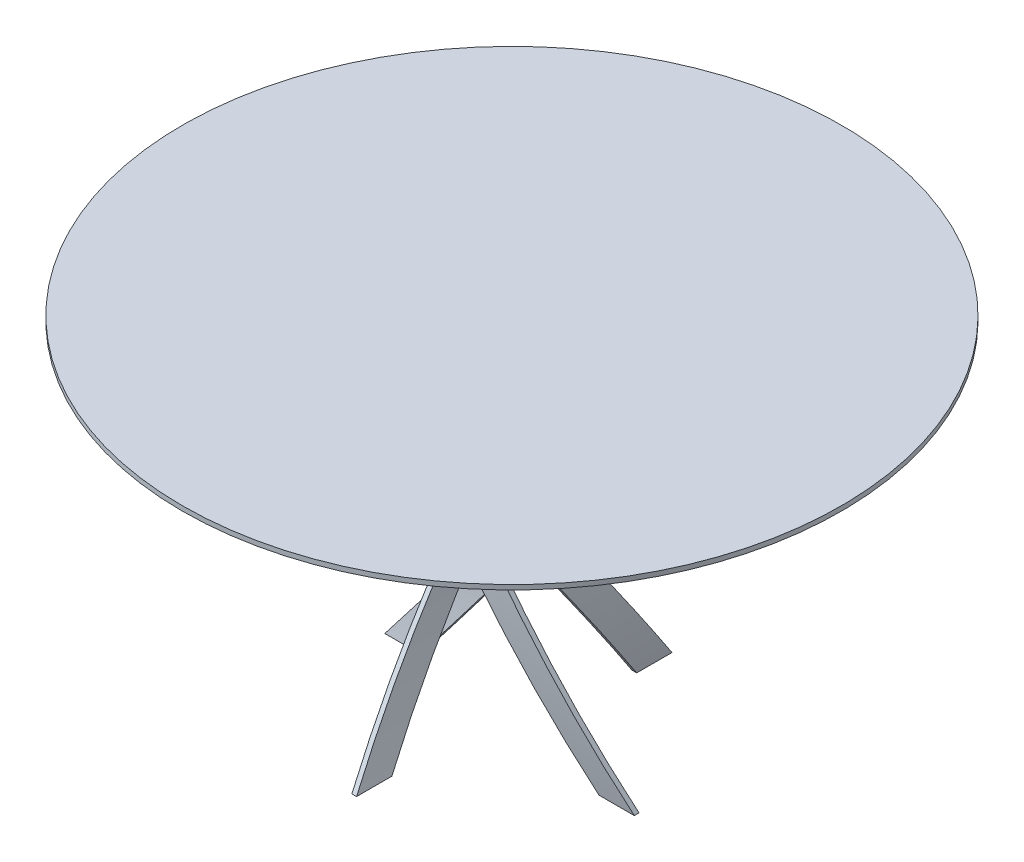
ISO-10303-21;
HEADER;
FILE_DESCRIPTION(('STEP AP214'),'2;1');
FILE_NAME('part.step','',(''),(''),'','','');
FILE_SCHEMA(('AUTOMOTIVE_DESIGN { 1 0 10303 214 1 1 1 1 }'));
ENDSEC;
DATA;
#1=APPLICATION_CONTEXT('core data for automotive mechanical design processes');
#2=APPLICATION_PROTOCOL_DEFINITION('international standard','automotive_design',2000,#1);
#3=PRODUCT_CONTEXT('',#1,'mechanical');
#4=PRODUCT('Part','Part','',(#3));
#5=PRODUCT_RELATED_PRODUCT_CATEGORY('part','',(#4));
#6=PRODUCT_DEFINITION_FORMATION('','',#4);
#7=PRODUCT_DEFINITION_CONTEXT('part definition',#1,'design');
#8=PRODUCT_DEFINITION('design','',#6,#7);
#9=PRODUCT_DEFINITION_SHAPE('','',#8);
#10=(LENGTH_UNIT() NAMED_UNIT(*) SI_UNIT(.MILLI.,.METRE.));
#11=(NAMED_UNIT(*) PLANE_ANGLE_UNIT() SI_UNIT($,.RADIAN.));
#12=(NAMED_UNIT(*) SI_UNIT($,.STERADIAN.) SOLID_ANGLE_UNIT());
#13=UNCERTAINTY_MEASURE_WITH_UNIT(LENGTH_MEASURE(1.E-05),#10,'distance_accuracy_value','');
#14=(GEOMETRIC_REPRESENTATION_CONTEXT(3) GLOBAL_UNCERTAINTY_ASSIGNED_CONTEXT((#13)) GLOBAL_UNIT_ASSIGNED_CONTEXT((#10,
#11,#12)) REPRESENTATION_CONTEXT('',''));
#15=CARTESIAN_POINT('',(0.,0.,0.));
#16=DIRECTION('',(0.,0.,1.));
#17=DIRECTION('',(1.,0.,0.));
#18=AXIS2_PLACEMENT_3D('',#15,#16,#17);
#19=CARTESIAN_POINT('',(-300.000000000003,-1.11022302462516E-13,299.999999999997));
#20=DIRECTION('',(0.,0.589469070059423,0.807790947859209));
#21=DIRECTION('',(0.,-0.807790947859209,0.589469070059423));
#22=AXIS2_PLACEMENT_3D('',#19,#20,#21);
#23=PLANE('',#22);
#24=DIRECTION('',(1.,0.,0.));
#25=VECTOR('',#24,1.);
#26=CARTESIAN_POINT('',(-299.999999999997,740.,-240.000000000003));
#27=LINE('',#26,#25);
#28=CARTESIAN_POINT('',(-39.9999999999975,740.,-240.));
#29=VERTEX_POINT('',#28);
#30=CARTESIAN_POINT('',(-29.9999999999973,740.,-240.));
#31=VERTEX_POINT('',#30);
#32=EDGE_CURVE('E109',#29,#31,#27,.T.);
#33=ORIENTED_EDGE('',*,*,#32,.F.);
#34=CARTESIAN_POINT('',(1721.56180703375,370.,30.0000000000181));
#35=DIRECTION('',(0.,0.589469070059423,0.807790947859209));
#36=DIRECTION('',(0.,0.807790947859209,-0.589469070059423));
#37=AXIS2_PLACEMENT_3D('',#34,#35,#36);
#38=ELLIPSE('',#37,2228.29929546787,1800.);
#39=CARTESIAN_POINT('',(-40.0000000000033,-1.11022302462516E-13,300.));
#40=VERTEX_POINT('',#39);
#41=EDGE_CURVE('E91',#29,#40,#38,.T.);
#42=ORIENTED_EDGE('',*,*,#41,.T.);
#43=DIRECTION('',(1.,0.,0.));
#44=VECTOR('',#43,1.);
#45=CARTESIAN_POINT('',(-300.000000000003,-1.11022302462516E-13,299.999999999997));
#46=LINE('',#45,#44);
#47=CARTESIAN_POINT('',(-30.0000000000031,-1.11022302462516E-13,300.));
#48=VERTEX_POINT('',#47);
#49=EDGE_CURVE('E111',#40,#48,#46,.T.);
#50=ORIENTED_EDGE('',*,*,#49,.T.);
#51=CARTESIAN_POINT('',(1731.56180703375,370.,30.0000000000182));
#52=DIRECTION('',(0.,0.589469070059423,0.807790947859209));
#53=DIRECTION('',(0.,0.807790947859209,-0.589469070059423));
#54=AXIS2_PLACEMENT_3D('',#51,#52,#53);
#55=ELLIPSE('',#54,2228.29929546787,1800.);
#56=EDGE_CURVE('E96',#48,#31,#55,.F.);
#57=ORIENTED_EDGE('',*,*,#56,.T.);
#58=EDGE_LOOP('',(#33,#42,#50,#57));
#59=FACE_BOUND('',#58,.T.);
#60=ADVANCED_FACE('F46',(#59),#23,.T.);
#61=CARTESIAN_POINT('',(1721.56180703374,370.,500.000000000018));
#62=DIRECTION('',(0.,0.,-1.));
#63=DIRECTION('',(-1.,0.,0.));
#64=AXIS2_PLACEMENT_3D('',#61,#62,#63);
#65=CYLINDRICAL_SURFACE('',#64,1800.);
#66=ORIENTED_EDGE('',*,*,#41,.F.);
#67=CARTESIAN_POINT('',(1721.56180703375,370.,-239.999999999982));
#68=DIRECTION('',(0.,0.,-1.));
#69=DIRECTION('',(0.,1.,0.));
#70=AXIS2_PLACEMENT_3D('',#67,#68,#69);
#71=CIRCLE('',#70,1800.);
#72=CARTESIAN_POINT('',(-58.4922044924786,637.222222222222,-240.000000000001));
#73=VERTEX_POINT('',#72);
#74=EDGE_CURVE('E87',#73,#29,#71,.T.);
#75=ORIENTED_EDGE('',*,*,#74,.F.);
#76=CARTESIAN_POINT('',(1721.56180703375,370.,-44.9999999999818));
#77=DIRECTION('',(0.,-0.589469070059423,-0.807790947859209));
#78=DIRECTION('',(0.,0.807790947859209,-0.589469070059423));
#79=AXIS2_PLACEMENT_3D('',#76,#77,#78);
#80=ELLIPSE('',#79,2228.29929546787,1800.);
#81=CARTESIAN_POINT('',(-40.0000000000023,-1.11022302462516E-13,225.));
#82=VERTEX_POINT('',#81);
#83=EDGE_CURVE('E50',#82,#73,#80,.T.);
#84=ORIENTED_EDGE('',*,*,#83,.F.);
#85=DIRECTION('',(0.,0.,-1.));
#86=VECTOR('',#85,1.);
#87=CARTESIAN_POINT('',(-40.0000000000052,0.,500.));
#88=LINE('',#87,#86);
#89=EDGE_CURVE('E70',#40,#82,#88,.T.);
#90=ORIENTED_EDGE('',*,*,#89,.F.);
#91=EDGE_LOOP('',(#66,#75,#84,#90));
#92=FACE_BOUND('',#91,.T.);
#93=ADVANCED_FACE('F89',(#92),#65,.T.);
#94=CARTESIAN_POINT('',(-299.999999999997,637.222222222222,-240.000000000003));
#95=DIRECTION('',(0.,-0.589469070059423,-0.807790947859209));
#96=DIRECTION('',(0.,0.807790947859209,-0.589469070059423));
#97=AXIS2_PLACEMENT_3D('',#94,#95,#96);
#98=PLANE('',#97);
#99=DIRECTION('',(1.,0.,0.));
#100=VECTOR('',#99,1.);
#101=CARTESIAN_POINT('',(-300.000000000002,-1.11022302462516E-13,224.999999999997));
#102=LINE('',#101,#100);
#103=CARTESIAN_POINT('',(-30.0000000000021,-1.11022302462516E-13,225.));
#104=VERTEX_POINT('',#103);
#105=EDGE_CURVE('E12',#82,#104,#102,.T.);
#106=ORIENTED_EDGE('',*,*,#105,.F.);
#107=ORIENTED_EDGE('',*,*,#83,.T.);
#108=DIRECTION('',(1.,0.,0.));
#109=VECTOR('',#108,1.);
#110=CARTESIAN_POINT('',(-299.999999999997,637.222222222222,-240.000000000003));
#111=LINE('',#110,#109);
#112=CARTESIAN_POINT('',(-48.4922044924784,637.222222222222,-240.));
#113=VERTEX_POINT('',#112);
#114=EDGE_CURVE('E55',#73,#113,#111,.T.);
#115=ORIENTED_EDGE('',*,*,#114,.T.);
#116=CARTESIAN_POINT('',(1731.56180703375,370.,-44.9999999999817));
#117=DIRECTION('',(0.,-0.589469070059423,-0.807790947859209));
#118=DIRECTION('',(0.,0.807790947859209,-0.589469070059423));
#119=AXIS2_PLACEMENT_3D('',#116,#117,#118);
#120=ELLIPSE('',#119,2228.29929546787,1800.);
#121=EDGE_CURVE('E101',#113,#104,#120,.F.);
#122=ORIENTED_EDGE('',*,*,#121,.T.);
#123=EDGE_LOOP('',(#106,#107,#115,#122));
#124=FACE_BOUND('',#123,.T.);
#125=ADVANCED_FACE('F48',(#124),#98,.T.);
#126=CARTESIAN_POINT('',(-299.999999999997,740.,-240.000000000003));
#127=DIRECTION('',(0.,0.,-1.));
#128=DIRECTION('',(0.,1.,0.));
#129=AXIS2_PLACEMENT_3D('',#126,#127,#128);
#130=PLANE('',#129);
#131=ORIENTED_EDGE('',*,*,#114,.F.);
#132=ORIENTED_EDGE('',*,*,#74,.T.);
#133=ORIENTED_EDGE('',*,*,#32,.T.);
#134=CARTESIAN_POINT('',(1731.56180703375,370.,-239.999999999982));
#135=DIRECTION('',(0.,0.,-1.));
#136=DIRECTION('',(0.,1.,0.));
#137=AXIS2_PLACEMENT_3D('',#134,#135,#136);
#138=CIRCLE('',#137,1800.);
#139=EDGE_CURVE('E97',#31,#113,#138,.F.);
#140=ORIENTED_EDGE('',*,*,#139,.T.);
#141=EDGE_LOOP('',(#131,#132,#133,#140));
#142=FACE_BOUND('',#141,.T.);
#143=ADVANCED_FACE('F102',(#142),#130,.T.);
#144=CARTESIAN_POINT('',(1731.56180703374,370.,500.000000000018));
#145=DIRECTION('',(0.,0.,-1.));
#146=DIRECTION('',(-1.,0.,0.));
#147=AXIS2_PLACEMENT_3D('',#144,#145,#146);
#148=CYLINDRICAL_SURFACE('',#147,1800.);
#149=ORIENTED_EDGE('',*,*,#56,.F.);
#150=DIRECTION('',(0.,0.,-1.));
#151=VECTOR('',#150,1.);
#152=CARTESIAN_POINT('',(-30.0000000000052,0.,500.));
#153=LINE('',#152,#151);
#154=EDGE_CURVE('E62',#48,#104,#153,.T.);
#155=ORIENTED_EDGE('',*,*,#154,.T.);
#156=ORIENTED_EDGE('',*,*,#121,.F.);
#157=ORIENTED_EDGE('',*,*,#139,.F.);
#158=EDGE_LOOP('',(#149,#155,#156,#157));
#159=FACE_BOUND('',#158,.T.);
#160=ADVANCED_FACE('F122',(#159),#148,.F.);
#161=CARTESIAN_POINT('',(-300.000000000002,-1.11022302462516E-13,224.999999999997));
#162=DIRECTION('',(0.,-1.,0.));
#163=DIRECTION('',(-1.,0.,0.));
#164=AXIS2_PLACEMENT_3D('',#161,#162,#163);
#165=PLANE('',#164);
#166=ORIENTED_EDGE('',*,*,#49,.F.);
#167=ORIENTED_EDGE('',*,*,#89,.T.);
#168=ORIENTED_EDGE('',*,*,#105,.T.);
#169=ORIENTED_EDGE('',*,*,#154,.F.);
#170=EDGE_LOOP('',(#166,#167,#168,#169));
#171=FACE_BOUND('',#170,.T.);
#172=ADVANCED_FACE('F119',(#171),#165,.T.);
#173=CLOSED_SHELL('',(#60,#93,#125,#143,#160,#172));
#174=MANIFOLD_SOLID_BREP('B2',#173);
#175=CARTESIAN_POINT('',(300.,-1.11022302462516E-13,300.));
#176=DIRECTION('',(0.807790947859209,0.589469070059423,0.));
#177=DIRECTION('',(0.589469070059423,-0.807790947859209,0.));
#178=AXIS2_PLACEMENT_3D('',#175,#176,#177);
#179=PLANE('',#178);
#180=DIRECTION('',(0.,0.,-1.));
#181=VECTOR('',#180,1.);
#182=CARTESIAN_POINT('',(-240.,740.,300.));
#183=LINE('',#182,#181);
#184=CARTESIAN_POINT('',(-240.,740.,40.));
#185=VERTEX_POINT('',#184);
#186=CARTESIAN_POINT('',(-240.,740.,29.9999999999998));
#187=VERTEX_POINT('',#186);
#188=EDGE_CURVE('E255',#185,#187,#183,.T.);
#189=ORIENTED_EDGE('',*,*,#188,.F.);
#190=CARTESIAN_POINT('',(30.,370.,-1721.56180703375));
#191=DIRECTION('',(0.807790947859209,0.589469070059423,0.));
#192=DIRECTION('',(-0.589469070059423,0.807790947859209,0.));
#193=AXIS2_PLACEMENT_3D('',#190,#191,#192);
#194=ELLIPSE('',#193,2228.29929546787,1800.);
#195=CARTESIAN_POINT('',(300.,-1.11022302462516E-13,40.0000000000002));
#196=VERTEX_POINT('',#195);
#197=EDGE_CURVE('E237',#185,#196,#194,.T.);
#198=ORIENTED_EDGE('',*,*,#197,.T.);
#199=DIRECTION('',(0.,0.,-1.));
#200=VECTOR('',#199,1.);
#201=CARTESIAN_POINT('',(300.,-1.11022302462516E-13,300.));
#202=LINE('',#201,#200);
#203=CARTESIAN_POINT('',(300.,-1.11022302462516E-13,30.));
#204=VERTEX_POINT('',#203);
#205=EDGE_CURVE('E257',#196,#204,#202,.T.);
#206=ORIENTED_EDGE('',*,*,#205,.T.);
#207=CARTESIAN_POINT('',(30.,370.,-1731.56180703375));
#208=DIRECTION('',(0.807790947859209,0.589469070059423,0.));
#209=DIRECTION('',(-0.589469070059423,0.807790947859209,0.));
#210=AXIS2_PLACEMENT_3D('',#207,#208,#209);
#211=ELLIPSE('',#210,2228.29929546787,1800.);
#212=EDGE_CURVE('E242',#204,#187,#211,.F.);
#213=ORIENTED_EDGE('',*,*,#212,.T.);
#214=EDGE_LOOP('',(#189,#198,#206,#213));
#215=FACE_BOUND('',#214,.T.);
#216=ADVANCED_FACE('F192',(#215),#179,.T.);
#217=CARTESIAN_POINT('',(500.,370.,-1721.56180703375));
#218=DIRECTION('',(-1.,0.,0.));
#219=DIRECTION('',(0.,0.,1.));
#220=AXIS2_PLACEMENT_3D('',#217,#218,#219);
#221=CYLINDRICAL_SURFACE('',#220,1800.);
#222=ORIENTED_EDGE('',*,*,#197,.F.);
#223=CARTESIAN_POINT('',(-240.,370.,-1721.56180703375));
#224=DIRECTION('',(-1.,0.,0.));
#225=DIRECTION('',(0.,1.,0.));
#226=AXIS2_PLACEMENT_3D('',#223,#224,#225);
#227=CIRCLE('',#226,1800.);
#228=CARTESIAN_POINT('',(-240.,637.222222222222,58.4922044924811));
#229=VERTEX_POINT('',#228);
#230=EDGE_CURVE('E233',#229,#185,#227,.T.);
#231=ORIENTED_EDGE('',*,*,#230,.F.);
#232=CARTESIAN_POINT('',(-44.9999999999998,370.,-1721.56180703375));
#233=DIRECTION('',(-0.807790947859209,-0.589469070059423,0.));
#234=DIRECTION('',(-0.589469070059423,0.807790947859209,0.));
#235=AXIS2_PLACEMENT_3D('',#232,#233,#234);
#236=ELLIPSE('',#235,2228.29929546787,1800.);
#237=CARTESIAN_POINT('',(225.,-1.11022302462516E-13,40.));
#238=VERTEX_POINT('',#237);
#239=EDGE_CURVE('E196',#238,#229,#236,.T.);
#240=ORIENTED_EDGE('',*,*,#239,.F.);
#241=DIRECTION('',(-1.,0.,0.));
#242=VECTOR('',#241,1.);
#243=CARTESIAN_POINT('',(500.,0.,40.));
#244=LINE('',#243,#242);
#245=EDGE_CURVE('E216',#196,#238,#244,.T.);
#246=ORIENTED_EDGE('',*,*,#245,.F.);
#247=EDGE_LOOP('',(#222,#231,#240,#246));
#248=FACE_BOUND('',#247,.T.);
#249=ADVANCED_FACE('F235',(#248),#221,.T.);
#250=CARTESIAN_POINT('',(-240.,637.222222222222,300.));
#251=DIRECTION('',(-0.807790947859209,-0.589469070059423,0.));
#252=DIRECTION('',(-0.589469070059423,0.807790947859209,0.));
#253=AXIS2_PLACEMENT_3D('',#250,#251,#252);
#254=PLANE('',#253);
#255=DIRECTION('',(0.,0.,-1.));
#256=VECTOR('',#255,1.);
#257=CARTESIAN_POINT('',(225.,-1.11022302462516E-13,300.));
#258=LINE('',#257,#256);
#259=CARTESIAN_POINT('',(225.,-1.11022302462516E-13,29.9999999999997));
#260=VERTEX_POINT('',#259);
#261=EDGE_CURVE('E44',#238,#260,#258,.T.);
#262=ORIENTED_EDGE('',*,*,#261,.F.);
#263=ORIENTED_EDGE('',*,*,#239,.T.);
#264=DIRECTION('',(0.,0.,-1.));
#265=VECTOR('',#264,1.);
#266=CARTESIAN_POINT('',(-240.,637.222222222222,300.));
#267=LINE('',#266,#265);
#268=CARTESIAN_POINT('',(-240.,637.222222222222,48.4922044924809));
#269=VERTEX_POINT('',#268);
#270=EDGE_CURVE('E201',#229,#269,#267,.T.);
#271=ORIENTED_EDGE('',*,*,#270,.T.);
#272=CARTESIAN_POINT('',(-44.9999999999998,370.,-1731.56180703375));
#273=DIRECTION('',(-0.807790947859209,-0.589469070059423,0.));
#274=DIRECTION('',(-0.589469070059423,0.807790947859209,0.));
#275=AXIS2_PLACEMENT_3D('',#272,#273,#274);
#276=ELLIPSE('',#275,2228.29929546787,1800.);
#277=EDGE_CURVE('E247',#269,#260,#276,.F.);
#278=ORIENTED_EDGE('',*,*,#277,.T.);
#279=EDGE_LOOP('',(#262,#263,#271,#278));
#280=FACE_BOUND('',#279,.T.);
#281=ADVANCED_FACE('F194',(#280),#254,.T.);
#282=CARTESIAN_POINT('',(-240.,740.,300.));
#283=DIRECTION('',(-1.,0.,0.));
#284=DIRECTION('',(0.,1.,0.));
#285=AXIS2_PLACEMENT_3D('',#282,#283,#284);
#286=PLANE('',#285);
#287=ORIENTED_EDGE('',*,*,#270,.F.);
#288=ORIENTED_EDGE('',*,*,#230,.T.);
#289=ORIENTED_EDGE('',*,*,#188,.T.);
#290=CARTESIAN_POINT('',(-240.,370.,-1731.56180703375));
#291=DIRECTION('',(-1.,0.,0.));
#292=DIRECTION('',(0.,1.,0.));
#293=AXIS2_PLACEMENT_3D('',#290,#291,#292);
#294=CIRCLE('',#293,1800.);
#295=EDGE_CURVE('E243',#187,#269,#294,.F.);
#296=ORIENTED_EDGE('',*,*,#295,.T.);
#297=EDGE_LOOP('',(#287,#288,#289,#296));
#298=FACE_BOUND('',#297,.T.);
#299=ADVANCED_FACE('F248',(#298),#286,.T.);
#300=CARTESIAN_POINT('',(500.,370.,-1731.56180703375));
#301=DIRECTION('',(-1.,0.,0.));
#302=DIRECTION('',(0.,0.,1.));
#303=AXIS2_PLACEMENT_3D('',#300,#301,#302);
#304=CYLINDRICAL_SURFACE('',#303,1800.);
#305=ORIENTED_EDGE('',*,*,#212,.F.);
#306=DIRECTION('',(-1.,0.,0.));
#307=VECTOR('',#306,1.);
#308=CARTESIAN_POINT('',(500.,0.,30.));
#309=LINE('',#308,#307);
#310=EDGE_CURVE('E208',#204,#260,#309,.T.);
#311=ORIENTED_EDGE('',*,*,#310,.T.);
#312=ORIENTED_EDGE('',*,*,#277,.F.);
#313=ORIENTED_EDGE('',*,*,#295,.F.);
#314=EDGE_LOOP('',(#305,#311,#312,#313));
#315=FACE_BOUND('',#314,.T.);
#316=ADVANCED_FACE('F268',(#315),#304,.F.);
#317=CARTESIAN_POINT('',(225.,-1.11022302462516E-13,300.));
#318=DIRECTION('',(0.,-1.,0.));
#319=DIRECTION('',(0.,0.,1.));
#320=AXIS2_PLACEMENT_3D('',#317,#318,#319);
#321=PLANE('',#320);
#322=ORIENTED_EDGE('',*,*,#205,.F.);
#323=ORIENTED_EDGE('',*,*,#245,.T.);
#324=ORIENTED_EDGE('',*,*,#261,.T.);
#325=ORIENTED_EDGE('',*,*,#310,.F.);
#326=EDGE_LOOP('',(#322,#323,#324,#325));
#327=FACE_BOUND('',#326,.T.);
#328=ADVANCED_FACE('F265',(#327),#321,.T.);
#329=CLOSED_SHELL('',(#216,#249,#281,#299,#316,#328));
#330=MANIFOLD_SOLID_BREP('B6',#329);
#331=CARTESIAN_POINT('',(300.000000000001,-1.11022302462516E-13,-299.999999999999));
#332=DIRECTION('',(0.,0.589469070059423,-0.807790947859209));
#333=DIRECTION('',(0.,-0.807790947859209,-0.589469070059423));
#334=AXIS2_PLACEMENT_3D('',#331,#332,#333);
#335=PLANE('',#334);
#336=DIRECTION('',(-1.,0.,0.));
#337=VECTOR('',#336,1.);
#338=CARTESIAN_POINT('',(299.999999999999,740.,240.000000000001));
#339=LINE('',#338,#337);
#340=CARTESIAN_POINT('',(39.9999999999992,740.,240.));
#341=VERTEX_POINT('',#340);
#342=CARTESIAN_POINT('',(29.999999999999,740.,240.));
#343=VERTEX_POINT('',#342);
#344=EDGE_CURVE('E401',#341,#343,#339,.T.);
#345=ORIENTED_EDGE('',*,*,#344,.F.);
#346=CARTESIAN_POINT('',(-1721.56180703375,370.,-30.000000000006));
#347=DIRECTION('',(0.,0.589469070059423,-0.807790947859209));
#348=DIRECTION('',(0.,0.807790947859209,0.589469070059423));
#349=AXIS2_PLACEMENT_3D('',#346,#347,#348);
#350=ELLIPSE('',#349,2228.29929546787,1800.);
#351=CARTESIAN_POINT('',(40.0000000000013,-1.11022302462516E-13,-300.));
#352=VERTEX_POINT('',#351);
#353=EDGE_CURVE('E383',#341,#352,#350,.T.);
#354=ORIENTED_EDGE('',*,*,#353,.T.);
#355=DIRECTION('',(-1.,0.,0.));
#356=VECTOR('',#355,1.);
#357=CARTESIAN_POINT('',(300.000000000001,-1.11022302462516E-13,-299.999999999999));
#358=LINE('',#357,#356);
#359=CARTESIAN_POINT('',(30.000000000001,-1.11022302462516E-13,-300.));
#360=VERTEX_POINT('',#359);
#361=EDGE_CURVE('E403',#352,#360,#358,.T.);
#362=ORIENTED_EDGE('',*,*,#361,.T.);
#363=CARTESIAN_POINT('',(-1731.56180703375,370.,-30.0000000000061));
#364=DIRECTION('',(0.,0.589469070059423,-0.807790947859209));
#365=DIRECTION('',(0.,0.807790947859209,0.589469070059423));
#366=AXIS2_PLACEMENT_3D('',#363,#364,#365);
#367=ELLIPSE('',#366,2228.29929546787,1800.);
#368=EDGE_CURVE('E388',#360,#343,#367,.F.);
#369=ORIENTED_EDGE('',*,*,#368,.T.);
#370=EDGE_LOOP('',(#345,#354,#362,#369));
#371=FACE_BOUND('',#370,.T.);
#372=ADVANCED_FACE('F338',(#371),#335,.T.);
#373=CARTESIAN_POINT('',(-1721.56180703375,370.,-500.000000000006));
#374=DIRECTION('',(0.,0.,1.));
#375=DIRECTION('',(1.,0.,0.));
#376=AXIS2_PLACEMENT_3D('',#373,#374,#375);
#377=CYLINDRICAL_SURFACE('',#376,1800.);
#378=ORIENTED_EDGE('',*,*,#353,.F.);
#379=CARTESIAN_POINT('',(-1721.56180703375,370.,239.999999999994));
#380=DIRECTION('',(0.,0.,1.));
#381=DIRECTION('',(0.,1.,0.));
#382=AXIS2_PLACEMENT_3D('',#379,#380,#381);
#383=CIRCLE('',#382,1800.);
#384=CARTESIAN_POINT('',(58.4922044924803,637.222222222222,240.));
#385=VERTEX_POINT('',#384);
#386=EDGE_CURVE('E379',#385,#341,#383,.T.);
#387=ORIENTED_EDGE('',*,*,#386,.F.);
#388=CARTESIAN_POINT('',(-1721.56180703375,370.,44.9999999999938));
#389=DIRECTION('',(0.,-0.589469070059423,0.807790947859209));
#390=DIRECTION('',(0.,0.807790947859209,0.589469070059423));
#391=AXIS2_PLACEMENT_3D('',#388,#389,#390);
#392=ELLIPSE('',#391,2228.29929546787,1800.);
#393=CARTESIAN_POINT('',(40.0000000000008,-1.11022302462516E-13,-225.));
#394=VERTEX_POINT('',#393);
#395=EDGE_CURVE('E342',#394,#385,#392,.T.);
#396=ORIENTED_EDGE('',*,*,#395,.F.);
#397=DIRECTION('',(0.,0.,1.));
#398=VECTOR('',#397,1.);
#399=CARTESIAN_POINT('',(40.0000000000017,0.,-500.));
#400=LINE('',#399,#398);
#401=EDGE_CURVE('E362',#352,#394,#400,.T.);
#402=ORIENTED_EDGE('',*,*,#401,.F.);
#403=EDGE_LOOP('',(#378,#387,#396,#402));
#404=FACE_BOUND('',#403,.T.);
#405=ADVANCED_FACE('F381',(#404),#377,.T.);
#406=CARTESIAN_POINT('',(299.999999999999,637.222222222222,240.000000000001));
#407=DIRECTION('',(0.,-0.589469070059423,0.807790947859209));
#408=DIRECTION('',(0.,0.807790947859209,0.589469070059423));
#409=AXIS2_PLACEMENT_3D('',#406,#407,#408);
#410=PLANE('',#409);
#411=DIRECTION('',(-1.,0.,0.));
#412=VECTOR('',#411,1.);
#413=CARTESIAN_POINT('',(300.000000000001,-1.11022302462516E-13,-224.999999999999));
#414=LINE('',#413,#412);
#415=CARTESIAN_POINT('',(30.0000000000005,-1.11022302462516E-13,-225.));
#416=VERTEX_POINT('',#415);
#417=EDGE_CURVE('E190',#394,#416,#414,.T.);
#418=ORIENTED_EDGE('',*,*,#417,.F.);
#419=ORIENTED_EDGE('',*,*,#395,.T.);
#420=DIRECTION('',(-1.,0.,0.));
#421=VECTOR('',#420,1.);
#422=CARTESIAN_POINT('',(299.999999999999,637.222222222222,240.000000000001));
#423=LINE('',#422,#421);
#424=CARTESIAN_POINT('',(48.49220449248,637.222222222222,240.));
#425=VERTEX_POINT('',#424);
#426=EDGE_CURVE('E347',#385,#425,#423,.T.);
#427=ORIENTED_EDGE('',*,*,#426,.T.);
#428=CARTESIAN_POINT('',(-1731.56180703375,370.,44.9999999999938));
#429=DIRECTION('',(0.,-0.589469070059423,0.807790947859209));
#430=DIRECTION('',(0.,0.807790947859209,0.589469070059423));
#431=AXIS2_PLACEMENT_3D('',#428,#429,#430);
#432=ELLIPSE('',#431,2228.29929546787,1800.);
#433=EDGE_CURVE('E393',#425,#416,#432,.F.);
#434=ORIENTED_EDGE('',*,*,#433,.T.);
#435=EDGE_LOOP('',(#418,#419,#427,#434));
#436=FACE_BOUND('',#435,.T.);
#437=ADVANCED_FACE('F340',(#436),#410,.T.);
#438=CARTESIAN_POINT('',(299.999999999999,740.,240.000000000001));
#439=DIRECTION('',(0.,0.,1.));
#440=DIRECTION('',(0.,1.,0.));
#441=AXIS2_PLACEMENT_3D('',#438,#439,#440);
#442=PLANE('',#441);
#443=ORIENTED_EDGE('',*,*,#426,.F.);
#444=ORIENTED_EDGE('',*,*,#386,.T.);
#445=ORIENTED_EDGE('',*,*,#344,.T.);
#446=CARTESIAN_POINT('',(-1731.56180703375,370.,239.999999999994));
#447=DIRECTION('',(0.,0.,1.));
#448=DIRECTION('',(0.,1.,0.));
#449=AXIS2_PLACEMENT_3D('',#446,#447,#448);
#450=CIRCLE('',#449,1800.);
#451=EDGE_CURVE('E389',#343,#425,#450,.F.);
#452=ORIENTED_EDGE('',*,*,#451,.T.);
#453=EDGE_LOOP('',(#443,#444,#445,#452));
#454=FACE_BOUND('',#453,.T.);
#455=ADVANCED_FACE('F394',(#454),#442,.T.);
#456=CARTESIAN_POINT('',(-1731.56180703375,370.,-500.000000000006));
#457=DIRECTION('',(0.,0.,1.));
#458=DIRECTION('',(1.,0.,0.));
#459=AXIS2_PLACEMENT_3D('',#456,#457,#458);
#460=CYLINDRICAL_SURFACE('',#459,1800.);
#461=ORIENTED_EDGE('',*,*,#368,.F.);
#462=DIRECTION('',(0.,0.,1.));
#463=VECTOR('',#462,1.);
#464=CARTESIAN_POINT('',(30.0000000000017,0.,-500.));
#465=LINE('',#464,#463);
#466=EDGE_CURVE('E354',#360,#416,#465,.T.);
#467=ORIENTED_EDGE('',*,*,#466,.T.);
#468=ORIENTED_EDGE('',*,*,#433,.F.);
#469=ORIENTED_EDGE('',*,*,#451,.F.);
#470=EDGE_LOOP('',(#461,#467,#468,#469));
#471=FACE_BOUND('',#470,.T.);
#472=ADVANCED_FACE('F414',(#471),#460,.F.);
#473=CARTESIAN_POINT('',(300.000000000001,-1.11022302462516E-13,-224.999999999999));
#474=DIRECTION('',(0.,-1.,0.));
#475=DIRECTION('',(1.,0.,0.));
#476=AXIS2_PLACEMENT_3D('',#473,#474,#475);
#477=PLANE('',#476);
#478=ORIENTED_EDGE('',*,*,#361,.F.);
#479=ORIENTED_EDGE('',*,*,#401,.T.);
#480=ORIENTED_EDGE('',*,*,#417,.T.);
#481=ORIENTED_EDGE('',*,*,#466,.F.);
#482=EDGE_LOOP('',(#478,#479,#480,#481));
#483=FACE_BOUND('',#482,.T.);
#484=ADVANCED_FACE('F411',(#483),#477,.T.);
#485=CLOSED_SHELL('',(#372,#405,#437,#455,#472,#484));
#486=MANIFOLD_SOLID_BREP('B38',#485);
#487=CARTESIAN_POINT('',(-300.,-1.11022302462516E-13,-300.));
#488=DIRECTION('',(-0.807790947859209,0.589469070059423,0.));
#489=DIRECTION('',(-0.589469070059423,-0.807790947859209,0.));
#490=AXIS2_PLACEMENT_3D('',#487,#488,#489);
#491=PLANE('',#490);
#492=DIRECTION('',(0.,0.,1.));
#493=VECTOR('',#492,1.);
#494=CARTESIAN_POINT('',(240.,740.,-300.));
#495=LINE('',#494,#493);
#496=CARTESIAN_POINT('',(240.,740.,-40.));
#497=VERTEX_POINT('',#496);
#498=CARTESIAN_POINT('',(240.,740.,-29.9999999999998));
#499=VERTEX_POINT('',#498);
#500=EDGE_CURVE('E544',#497,#499,#495,.T.);
#501=ORIENTED_EDGE('',*,*,#500,.F.);
#502=CARTESIAN_POINT('',(-30.,370.,1721.56180703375));
#503=DIRECTION('',(-0.807790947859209,0.589469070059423,0.));
#504=DIRECTION('',(0.589469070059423,0.807790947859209,0.));
#505=AXIS2_PLACEMENT_3D('',#502,#503,#504);
#506=ELLIPSE('',#505,2228.29929546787,1800.);
#507=CARTESIAN_POINT('',(-300.,-1.11022302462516E-13,-40.0000000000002));
#508=VERTEX_POINT('',#507);
#509=EDGE_CURVE('E526',#497,#508,#506,.T.);
#510=ORIENTED_EDGE('',*,*,#509,.T.);
#511=DIRECTION('',(0.,0.,1.));
#512=VECTOR('',#511,1.);
#513=CARTESIAN_POINT('',(-300.,-1.11022302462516E-13,-300.));
#514=LINE('',#513,#512);
#515=CARTESIAN_POINT('',(-300.,-1.11022302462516E-13,-30.));
#516=VERTEX_POINT('',#515);
#517=EDGE_CURVE('E546',#508,#516,#514,.T.);
#518=ORIENTED_EDGE('',*,*,#517,.T.);
#519=CARTESIAN_POINT('',(-30.,370.,1731.56180703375));
#520=DIRECTION('',(-0.807790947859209,0.589469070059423,0.));
#521=DIRECTION('',(0.589469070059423,0.807790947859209,0.));
#522=AXIS2_PLACEMENT_3D('',#519,#520,#521);
#523=ELLIPSE('',#522,2228.29929546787,1800.);
#524=EDGE_CURVE('E531',#516,#499,#523,.F.);
#525=ORIENTED_EDGE('',*,*,#524,.T.);
#526=EDGE_LOOP('',(#501,#510,#518,#525));
#527=FACE_BOUND('',#526,.T.);
#528=ADVANCED_FACE('F481',(#527),#491,.T.);
#529=CARTESIAN_POINT('',(-500.,370.,1721.56180703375));
#530=DIRECTION('',(1.,0.,0.));
#531=DIRECTION('',(0.,0.,-1.));
#532=AXIS2_PLACEMENT_3D('',#529,#530,#531);
#533=CYLINDRICAL_SURFACE('',#532,1800.);
#534=ORIENTED_EDGE('',*,*,#509,.F.);
#535=CARTESIAN_POINT('',(240.,370.,1721.56180703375));
#536=DIRECTION('',(1.,0.,0.));
#537=DIRECTION('',(0.,1.,0.));
#538=AXIS2_PLACEMENT_3D('',#535,#536,#537);
#539=CIRCLE('',#538,1800.);
#540=CARTESIAN_POINT('',(240.,637.222222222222,-58.4922044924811));
#541=VERTEX_POINT('',#540);
#542=EDGE_CURVE('E522',#541,#497,#539,.T.);
#543=ORIENTED_EDGE('',*,*,#542,.F.);
#544=CARTESIAN_POINT('',(44.9999999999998,370.,1721.56180703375));
#545=DIRECTION('',(0.807790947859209,-0.589469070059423,0.));
#546=DIRECTION('',(0.589469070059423,0.807790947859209,0.));
#547=AXIS2_PLACEMENT_3D('',#544,#545,#546);
#548=ELLIPSE('',#547,2228.29929546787,1800.);
#549=CARTESIAN_POINT('',(-225.,-1.11022302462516E-13,-40.));
#550=VERTEX_POINT('',#549);
#551=EDGE_CURVE('E485',#550,#541,#548,.T.);
#552=ORIENTED_EDGE('',*,*,#551,.F.);
#553=DIRECTION('',(1.,0.,0.));
#554=VECTOR('',#553,1.);
#555=CARTESIAN_POINT('',(-500.,0.,-40.));
#556=LINE('',#555,#554);
#557=EDGE_CURVE('E505',#508,#550,#556,.T.);
#558=ORIENTED_EDGE('',*,*,#557,.F.);
#559=EDGE_LOOP('',(#534,#543,#552,#558));
#560=FACE_BOUND('',#559,.T.);
#561=ADVANCED_FACE('F524',(#560),#533,.T.);
#562=CARTESIAN_POINT('',(240.,637.222222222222,-300.));
#563=DIRECTION('',(0.807790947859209,-0.589469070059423,0.));
#564=DIRECTION('',(0.589469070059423,0.807790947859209,0.));
#565=AXIS2_PLACEMENT_3D('',#562,#563,#564);
#566=PLANE('',#565);
#567=DIRECTION('',(0.,0.,1.));
#568=VECTOR('',#567,1.);
#569=CARTESIAN_POINT('',(-225.,-1.11022302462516E-13,-300.));
#570=LINE('',#569,#568);
#571=CARTESIAN_POINT('',(-225.,-1.11022302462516E-13,-29.9999999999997));
#572=VERTEX_POINT('',#571);
#573=EDGE_CURVE('E336',#550,#572,#570,.T.);
#574=ORIENTED_EDGE('',*,*,#573,.F.);
#575=ORIENTED_EDGE('',*,*,#551,.T.);
#576=DIRECTION('',(0.,0.,1.));
#577=VECTOR('',#576,1.);
#578=CARTESIAN_POINT('',(240.,637.222222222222,-300.));
#579=LINE('',#578,#577);
#580=CARTESIAN_POINT('',(240.,637.222222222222,-48.4922044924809));
#581=VERTEX_POINT('',#580);
#582=EDGE_CURVE('E490',#541,#581,#579,.T.);
#583=ORIENTED_EDGE('',*,*,#582,.T.);
#584=CARTESIAN_POINT('',(44.9999999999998,370.,1731.56180703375));
#585=DIRECTION('',(0.807790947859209,-0.589469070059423,0.));
#586=DIRECTION('',(0.589469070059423,0.807790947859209,0.));
#587=AXIS2_PLACEMENT_3D('',#584,#585,#586);
#588=ELLIPSE('',#587,2228.29929546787,1800.);
#589=EDGE_CURVE('E536',#581,#572,#588,.F.);
#590=ORIENTED_EDGE('',*,*,#589,.T.);
#591=EDGE_LOOP('',(#574,#575,#583,#590));
#592=FACE_BOUND('',#591,.T.);
#593=ADVANCED_FACE('F483',(#592),#566,.T.);
#594=CARTESIAN_POINT('',(240.,740.,-300.));
#595=DIRECTION('',(1.,0.,0.));
#596=DIRECTION('',(0.,1.,0.));
#597=AXIS2_PLACEMENT_3D('',#594,#595,#596);
#598=PLANE('',#597);
#599=ORIENTED_EDGE('',*,*,#582,.F.);
#600=ORIENTED_EDGE('',*,*,#542,.T.);
#601=ORIENTED_EDGE('',*,*,#500,.T.);
#602=CARTESIAN_POINT('',(240.,370.,1731.56180703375));
#603=DIRECTION('',(1.,0.,0.));
#604=DIRECTION('',(0.,1.,0.));
#605=AXIS2_PLACEMENT_3D('',#602,#603,#604);
#606=CIRCLE('',#605,1800.);
#607=EDGE_CURVE('E532',#499,#581,#606,.F.);
#608=ORIENTED_EDGE('',*,*,#607,.T.);
#609=EDGE_LOOP('',(#599,#600,#601,#608));
#610=FACE_BOUND('',#609,.T.);
#611=ADVANCED_FACE('F537',(#610),#598,.T.);
#612=CARTESIAN_POINT('',(-500.,370.,1731.56180703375));
#613=DIRECTION('',(1.,0.,0.));
#614=DIRECTION('',(0.,0.,-1.));
#615=AXIS2_PLACEMENT_3D('',#612,#613,#614);
#616=CYLINDRICAL_SURFACE('',#615,1800.);
#617=ORIENTED_EDGE('',*,*,#524,.F.);
#618=DIRECTION('',(1.,0.,0.));
#619=VECTOR('',#618,1.);
#620=CARTESIAN_POINT('',(-500.,0.,-30.));
#621=LINE('',#620,#619);
#622=EDGE_CURVE('E497',#516,#572,#621,.T.);
#623=ORIENTED_EDGE('',*,*,#622,.T.);
#624=ORIENTED_EDGE('',*,*,#589,.F.);
#625=ORIENTED_EDGE('',*,*,#607,.F.);
#626=EDGE_LOOP('',(#617,#623,#624,#625));
#627=FACE_BOUND('',#626,.T.);
#628=ADVANCED_FACE('F557',(#627),#616,.F.);
#629=CARTESIAN_POINT('',(-225.,-1.11022302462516E-13,-300.));
#630=DIRECTION('',(0.,-1.,0.));
#631=DIRECTION('',(0.,0.,-1.));
#632=AXIS2_PLACEMENT_3D('',#629,#630,#631);
#633=PLANE('',#632);
#634=ORIENTED_EDGE('',*,*,#517,.F.);
#635=ORIENTED_EDGE('',*,*,#557,.T.);
#636=ORIENTED_EDGE('',*,*,#573,.T.);
#637=ORIENTED_EDGE('',*,*,#622,.F.);
#638=EDGE_LOOP('',(#634,#635,#636,#637));
#639=FACE_BOUND('',#638,.T.);
#640=ADVANCED_FACE('F554',(#639),#633,.T.);
#641=CLOSED_SHELL('',(#528,#561,#593,#611,#628,#640));
#642=MANIFOLD_SOLID_BREP('B184',#641);
#643=CARTESIAN_POINT('',(0.,750.,0.));
#644=DIRECTION('',(0.,-1.,0.));
#645=DIRECTION('',(0.,0.,-1.));
#646=AXIS2_PLACEMENT_3D('',#643,#644,#645);
#647=CYLINDRICAL_SURFACE('',#646,700.);
#648=CARTESIAN_POINT('',(0.,750.,0.));
#649=DIRECTION('',(0.,1.,0.));
#650=DIRECTION('',(0.,0.,1.));
#651=AXIS2_PLACEMENT_3D('',#648,#649,#650);
#652=CIRCLE('',#651,700.);
#653=CARTESIAN_POINT('',(0.,750.,700.));
#654=VERTEX_POINT('',#653);
#655=EDGE_CURVE('E480',#654,#654,#652,.T.);
#656=ORIENTED_EDGE('',*,*,#655,.F.);
#657=EDGE_LOOP('',(#656));
#658=FACE_BOUND('',#657,.T.);
#659=CARTESIAN_POINT('',(0.,740.,0.));
#660=DIRECTION('',(0.,1.,0.));
#661=DIRECTION('',(0.,0.,1.));
#662=AXIS2_PLACEMENT_3D('',#659,#660,#661);
#663=CIRCLE('',#662,700.);
#664=CARTESIAN_POINT('',(0.,740.,700.));
#665=VERTEX_POINT('',#664);
#666=EDGE_CURVE('E608',#665,#665,#663,.T.);
#667=ORIENTED_EDGE('',*,*,#666,.T.);
#668=EDGE_LOOP('',(#667));
#669=FACE_BOUND('',#668,.T.);
#670=ADVANCED_FACE('F605',(#658,#669),#647,.T.);
#671=CARTESIAN_POINT('',(0.,750.,0.));
#672=DIRECTION('',(0.,1.,0.));
#673=DIRECTION('',(0.,0.,1.));
#674=AXIS2_PLACEMENT_3D('',#671,#672,#673);
#675=PLANE('',#674);
#676=ORIENTED_EDGE('',*,*,#655,.T.);
#677=EDGE_LOOP('',(#676));
#678=FACE_BOUND('',#677,.T.);
#679=ADVANCED_FACE('F620',(#678),#675,.T.);
#680=CARTESIAN_POINT('',(0.,740.,0.));
#681=DIRECTION('',(0.,1.,0.));
#682=DIRECTION('',(0.,0.,1.));
#683=AXIS2_PLACEMENT_3D('',#680,#681,#682);
#684=PLANE('',#683);
#685=ORIENTED_EDGE('',*,*,#666,.F.);
#686=EDGE_LOOP('',(#685));
#687=FACE_BOUND('',#686,.T.);
#688=ADVANCED_FACE('F618',(#687),#684,.F.);
#689=CLOSED_SHELL('',(#670,#679,#688));
#690=MANIFOLD_SOLID_BREP('B330',#689);
#691=ADVANCED_BREP_SHAPE_REPRESENTATION('',(#18,#174,#330,#486,#642,#690),#14);
#692=SHAPE_DEFINITION_REPRESENTATION(#9,#691);
ENDSEC;
END-ISO-10303-21;
